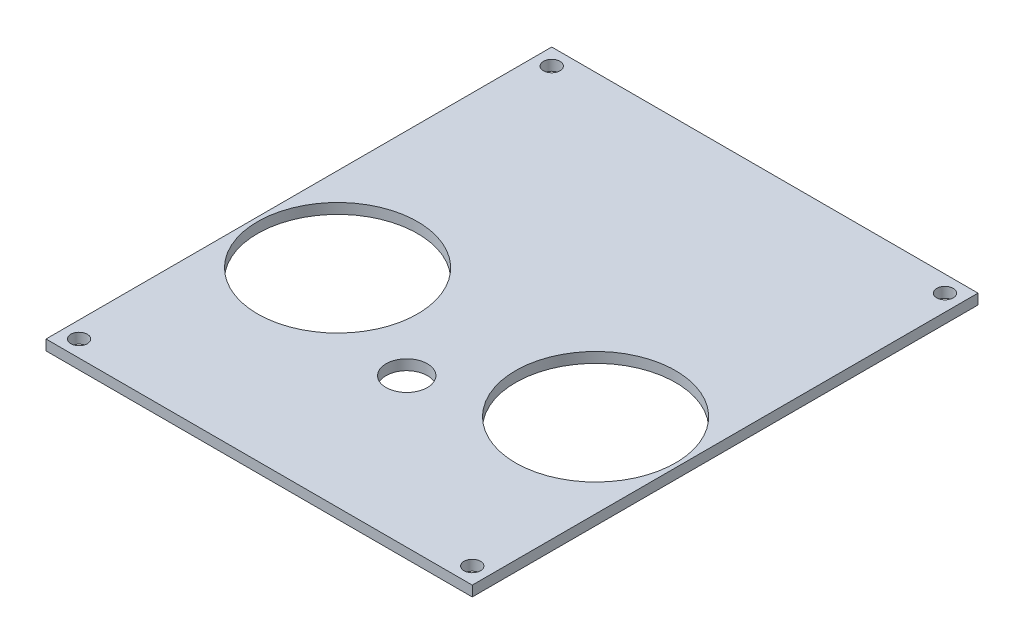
ISO-10303-21;
HEADER;
FILE_DESCRIPTION(('STEP AP214'),'2;1');
FILE_NAME('part.step','',(''),(''),'','','');
FILE_SCHEMA(('AUTOMOTIVE_DESIGN { 1 0 10303 214 1 1 1 1 }'));
ENDSEC;
DATA;
#1=APPLICATION_CONTEXT('core data for automotive mechanical design processes');
#2=APPLICATION_PROTOCOL_DEFINITION('international standard','automotive_design',2000,#1);
#3=PRODUCT_CONTEXT('',#1,'mechanical');
#4=PRODUCT('Part','Part','',(#3));
#5=PRODUCT_RELATED_PRODUCT_CATEGORY('part','',(#4));
#6=PRODUCT_DEFINITION_FORMATION('','',#4);
#7=PRODUCT_DEFINITION_CONTEXT('part definition',#1,'design');
#8=PRODUCT_DEFINITION('design','',#6,#7);
#9=PRODUCT_DEFINITION_SHAPE('','',#8);
#10=(LENGTH_UNIT() NAMED_UNIT(*) SI_UNIT(.MILLI.,.METRE.));
#11=(NAMED_UNIT(*) PLANE_ANGLE_UNIT() SI_UNIT($,.RADIAN.));
#12=(NAMED_UNIT(*) SI_UNIT($,.STERADIAN.) SOLID_ANGLE_UNIT());
#13=UNCERTAINTY_MEASURE_WITH_UNIT(LENGTH_MEASURE(1.E-05),#10,'distance_accuracy_value','');
#14=(GEOMETRIC_REPRESENTATION_CONTEXT(3) GLOBAL_UNCERTAINTY_ASSIGNED_CONTEXT((#13)) GLOBAL_UNIT_ASSIGNED_CONTEXT((#10,
#11,#12)) REPRESENTATION_CONTEXT('',''));
#15=CARTESIAN_POINT('',(0.,0.,0.));
#16=DIRECTION('',(0.,0.,1.));
#17=DIRECTION('',(1.,0.,0.));
#18=AXIS2_PLACEMENT_3D('',#15,#16,#17);
#19=CARTESIAN_POINT('',(-41.3,2.,-49.));
#20=DIRECTION('',(1.,0.,0.));
#21=DIRECTION('',(0.,0.,-1.));
#22=AXIS2_PLACEMENT_3D('',#19,#20,#21);
#23=PLANE('',#22);
#24=DIRECTION('',(0.,0.,1.));
#25=VECTOR('',#24,1.);
#26=CARTESIAN_POINT('',(-41.3,0.,-49.));
#27=LINE('',#26,#25);
#28=CARTESIAN_POINT('',(-41.3,0.,-49.));
#29=VERTEX_POINT('',#28);
#30=CARTESIAN_POINT('',(-41.3,0.,49.));
#31=VERTEX_POINT('',#30);
#32=EDGE_CURVE('E95',#29,#31,#27,.T.);
#33=ORIENTED_EDGE('',*,*,#32,.T.);
#34=DIRECTION('',(0.,-1.,0.));
#35=VECTOR('',#34,1.);
#36=CARTESIAN_POINT('',(-41.3,2.,49.));
#37=LINE('',#36,#35);
#38=CARTESIAN_POINT('',(-41.3,2.,49.));
#39=VERTEX_POINT('',#38);
#40=EDGE_CURVE('E11',#39,#31,#37,.T.);
#41=ORIENTED_EDGE('',*,*,#40,.F.);
#42=DIRECTION('',(0.,0.,1.));
#43=VECTOR('',#42,1.);
#44=CARTESIAN_POINT('',(-41.3,2.,-49.));
#45=LINE('',#44,#43);
#46=CARTESIAN_POINT('',(-41.3,2.,-49.));
#47=VERTEX_POINT('',#46);
#48=EDGE_CURVE('E83',#47,#39,#45,.T.);
#49=ORIENTED_EDGE('',*,*,#48,.F.);
#50=DIRECTION('',(0.,-1.,0.));
#51=VECTOR('',#50,1.);
#52=CARTESIAN_POINT('',(-41.3,2.,-49.));
#53=LINE('',#52,#51);
#54=EDGE_CURVE('E91',#47,#29,#53,.T.);
#55=ORIENTED_EDGE('',*,*,#54,.T.);
#56=EDGE_LOOP('',(#33,#41,#49,#55));
#57=FACE_BOUND('',#56,.T.);
#58=ADVANCED_FACE('F32',(#57),#23,.F.);
#59=CARTESIAN_POINT('',(41.3,2.,49.));
#60=DIRECTION('',(0.,0.,-1.));
#61=DIRECTION('',(-1.,0.,0.));
#62=AXIS2_PLACEMENT_3D('',#59,#60,#61);
#63=PLANE('',#62);
#64=DIRECTION('',(1.,0.,0.));
#65=VECTOR('',#64,1.);
#66=CARTESIAN_POINT('',(41.3,0.,49.));
#67=LINE('',#66,#65);
#68=CARTESIAN_POINT('',(41.3,0.,49.));
#69=VERTEX_POINT('',#68);
#70=EDGE_CURVE('E87',#31,#69,#67,.T.);
#71=ORIENTED_EDGE('',*,*,#70,.T.);
#72=DIRECTION('',(0.,-1.,0.));
#73=VECTOR('',#72,1.);
#74=CARTESIAN_POINT('',(41.3,2.,49.));
#75=LINE('',#74,#73);
#76=CARTESIAN_POINT('',(41.3,2.,49.));
#77=VERTEX_POINT('',#76);
#78=EDGE_CURVE('E40',#77,#69,#75,.T.);
#79=ORIENTED_EDGE('',*,*,#78,.F.);
#80=DIRECTION('',(1.,0.,0.));
#81=VECTOR('',#80,1.);
#82=CARTESIAN_POINT('',(41.3,2.,49.));
#83=LINE('',#82,#81);
#84=EDGE_CURVE('E78',#39,#77,#83,.T.);
#85=ORIENTED_EDGE('',*,*,#84,.F.);
#86=ORIENTED_EDGE('',*,*,#40,.T.);
#87=EDGE_LOOP('',(#71,#79,#85,#86));
#88=FACE_BOUND('',#87,.T.);
#89=ADVANCED_FACE('F86',(#88),#63,.F.);
#90=CARTESIAN_POINT('',(41.3,2.,-49.));
#91=DIRECTION('',(-1.,0.,0.));
#92=DIRECTION('',(0.,0.,1.));
#93=AXIS2_PLACEMENT_3D('',#90,#91,#92);
#94=PLANE('',#93);
#95=DIRECTION('',(0.,0.,-1.));
#96=VECTOR('',#95,1.);
#97=CARTESIAN_POINT('',(41.3,0.,-49.));
#98=LINE('',#97,#96);
#99=CARTESIAN_POINT('',(41.3,0.,-49.));
#100=VERTEX_POINT('',#99);
#101=EDGE_CURVE('E65',#69,#100,#98,.T.);
#102=ORIENTED_EDGE('',*,*,#101,.T.);
#103=DIRECTION('',(0.,-1.,0.));
#104=VECTOR('',#103,1.);
#105=CARTESIAN_POINT('',(41.3,2.,-49.));
#106=LINE('',#105,#104);
#107=CARTESIAN_POINT('',(41.3,2.,-49.));
#108=VERTEX_POINT('',#107);
#109=EDGE_CURVE('E88',#108,#100,#106,.T.);
#110=ORIENTED_EDGE('',*,*,#109,.F.);
#111=DIRECTION('',(0.,0.,-1.));
#112=VECTOR('',#111,1.);
#113=CARTESIAN_POINT('',(41.3,2.,-49.));
#114=LINE('',#113,#112);
#115=EDGE_CURVE('E81',#77,#108,#114,.T.);
#116=ORIENTED_EDGE('',*,*,#115,.F.);
#117=ORIENTED_EDGE('',*,*,#78,.T.);
#118=EDGE_LOOP('',(#102,#110,#116,#117));
#119=FACE_BOUND('',#118,.T.);
#120=ADVANCED_FACE('F89',(#119),#94,.F.);
#121=CARTESIAN_POINT('',(41.3,2.,-49.));
#122=DIRECTION('',(0.,0.,1.));
#123=DIRECTION('',(1.,0.,0.));
#124=AXIS2_PLACEMENT_3D('',#121,#122,#123);
#125=PLANE('',#124);
#126=DIRECTION('',(-1.,0.,0.));
#127=VECTOR('',#126,1.);
#128=CARTESIAN_POINT('',(41.3,0.,-49.));
#129=LINE('',#128,#127);
#130=EDGE_CURVE('E71',#100,#29,#129,.T.);
#131=ORIENTED_EDGE('',*,*,#130,.T.);
#132=ORIENTED_EDGE('',*,*,#54,.F.);
#133=DIRECTION('',(-1.,0.,0.));
#134=VECTOR('',#133,1.);
#135=CARTESIAN_POINT('',(41.3,2.,-49.));
#136=LINE('',#135,#134);
#137=EDGE_CURVE('E48',#108,#47,#136,.T.);
#138=ORIENTED_EDGE('',*,*,#137,.F.);
#139=ORIENTED_EDGE('',*,*,#109,.T.);
#140=EDGE_LOOP('',(#131,#132,#138,#139));
#141=FACE_BOUND('',#140,.T.);
#142=ADVANCED_FACE('F103',(#141),#125,.F.);
#143=CARTESIAN_POINT('',(0.,2.,0.));
#144=DIRECTION('',(0.,-1.,0.));
#145=DIRECTION('',(0.,0.,-1.));
#146=AXIS2_PLACEMENT_3D('',#143,#144,#145);
#147=PLANE('',#146);
#148=CARTESIAN_POINT('',(-0.199999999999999,2.,20.2));
#149=DIRECTION('',(0.,-1.,0.));
#150=DIRECTION('',(0.,0.,-1.));
#151=AXIS2_PLACEMENT_3D('',#148,#149,#150);
#152=CIRCLE('',#151,4.);
#153=CARTESIAN_POINT('',(-0.199999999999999,2.,16.2));
#154=VERTEX_POINT('',#153);
#155=EDGE_CURVE('E142',#154,#154,#152,.T.);
#156=ORIENTED_EDGE('',*,*,#155,.T.);
#157=EDGE_LOOP('',(#156));
#158=FACE_BOUND('',#157,.T.);
#159=CARTESIAN_POINT('',(25.,2.,8.8));
#160=DIRECTION('',(0.,1.,0.));
#161=DIRECTION('',(0.,0.,1.));
#162=AXIS2_PLACEMENT_3D('',#159,#160,#161);
#163=CIRCLE('',#162,15.5);
#164=CARTESIAN_POINT('',(25.,2.,24.3));
#165=VERTEX_POINT('',#164);
#166=EDGE_CURVE('E139',#165,#165,#163,.T.);
#167=ORIENTED_EDGE('',*,*,#166,.F.);
#168=EDGE_LOOP('',(#167));
#169=FACE_BOUND('',#168,.T.);
#170=CARTESIAN_POINT('',(-25.,2.,8.8));
#171=DIRECTION('',(0.,1.,0.));
#172=DIRECTION('',(0.,0.,1.));
#173=AXIS2_PLACEMENT_3D('',#170,#171,#172);
#174=CIRCLE('',#173,15.5);
#175=CARTESIAN_POINT('',(-25.,2.,24.3));
#176=VERTEX_POINT('',#175);
#177=EDGE_CURVE('E133',#176,#176,#174,.T.);
#178=ORIENTED_EDGE('',*,*,#177,.F.);
#179=EDGE_LOOP('',(#178));
#180=FACE_BOUND('',#179,.T.);
#181=CARTESIAN_POINT('',(-38.1,2.,-45.8));
#182=DIRECTION('',(0.,1.,0.));
#183=DIRECTION('',(0.,0.,1.));
#184=AXIS2_PLACEMENT_3D('',#181,#182,#183);
#185=CIRCLE('',#184,1.59999999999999);
#186=CARTESIAN_POINT('',(-38.1,2.,-44.2));
#187=VERTEX_POINT('',#186);
#188=EDGE_CURVE('E129',#187,#187,#185,.T.);
#189=ORIENTED_EDGE('',*,*,#188,.F.);
#190=EDGE_LOOP('',(#189));
#191=FACE_BOUND('',#190,.T.);
#192=CARTESIAN_POINT('',(38.1,2.,-45.8));
#193=DIRECTION('',(0.,1.,0.));
#194=DIRECTION('',(0.,0.,1.));
#195=AXIS2_PLACEMENT_3D('',#192,#193,#194);
#196=CIRCLE('',#195,1.59999999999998);
#197=CARTESIAN_POINT('',(38.1,2.,-44.2));
#198=VERTEX_POINT('',#197);
#199=EDGE_CURVE('E123',#198,#198,#196,.T.);
#200=ORIENTED_EDGE('',*,*,#199,.F.);
#201=EDGE_LOOP('',(#200));
#202=FACE_BOUND('',#201,.T.);
#203=CARTESIAN_POINT('',(38.1,2.,45.8));
#204=DIRECTION('',(0.,1.,0.));
#205=DIRECTION('',(0.,0.,1.));
#206=AXIS2_PLACEMENT_3D('',#203,#204,#205);
#207=CIRCLE('',#206,1.59999999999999);
#208=CARTESIAN_POINT('',(38.1,2.,47.4));
#209=VERTEX_POINT('',#208);
#210=EDGE_CURVE('E117',#209,#209,#207,.T.);
#211=ORIENTED_EDGE('',*,*,#210,.F.);
#212=EDGE_LOOP('',(#211));
#213=FACE_BOUND('',#212,.T.);
#214=CARTESIAN_POINT('',(-38.1,2.,45.8));
#215=DIRECTION('',(0.,1.,0.));
#216=DIRECTION('',(0.,0.,1.));
#217=AXIS2_PLACEMENT_3D('',#214,#215,#216);
#218=CIRCLE('',#217,1.59999999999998);
#219=CARTESIAN_POINT('',(-38.1,2.,47.4));
#220=VERTEX_POINT('',#219);
#221=EDGE_CURVE('E111',#220,#220,#218,.T.);
#222=ORIENTED_EDGE('',*,*,#221,.F.);
#223=EDGE_LOOP('',(#222));
#224=FACE_BOUND('',#223,.T.);
#225=ORIENTED_EDGE('',*,*,#48,.T.);
#226=ORIENTED_EDGE('',*,*,#84,.T.);
#227=ORIENTED_EDGE('',*,*,#115,.T.);
#228=ORIENTED_EDGE('',*,*,#137,.T.);
#229=EDGE_LOOP('',(#225,#226,#227,#228));
#230=FACE_BOUND('',#229,.T.);
#231=ADVANCED_FACE('F79',(#158,#169,#180,#191,#202,#213,#224,#230),#147,.F.);
#232=CARTESIAN_POINT('',(0.,0.,0.));
#233=DIRECTION('',(0.,-1.,0.));
#234=DIRECTION('',(0.,0.,-1.));
#235=AXIS2_PLACEMENT_3D('',#232,#233,#234);
#236=PLANE('',#235);
#237=CARTESIAN_POINT('',(-0.199999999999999,0.,20.2));
#238=DIRECTION('',(0.,-1.,0.));
#239=DIRECTION('',(0.,0.,-1.));
#240=AXIS2_PLACEMENT_3D('',#237,#238,#239);
#241=CIRCLE('',#240,4.);
#242=CARTESIAN_POINT('',(-0.199999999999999,0.,16.2));
#243=VERTEX_POINT('',#242);
#244=EDGE_CURVE('E147',#243,#243,#241,.T.);
#245=ORIENTED_EDGE('',*,*,#244,.F.);
#246=EDGE_LOOP('',(#245));
#247=FACE_BOUND('',#246,.T.);
#248=CARTESIAN_POINT('',(25.,0.,8.8));
#249=DIRECTION('',(0.,1.,0.));
#250=DIRECTION('',(0.,0.,1.));
#251=AXIS2_PLACEMENT_3D('',#248,#249,#250);
#252=CIRCLE('',#251,15.5);
#253=CARTESIAN_POINT('',(25.,0.,24.3));
#254=VERTEX_POINT('',#253);
#255=EDGE_CURVE('E136',#254,#254,#252,.T.);
#256=ORIENTED_EDGE('',*,*,#255,.T.);
#257=EDGE_LOOP('',(#256));
#258=FACE_BOUND('',#257,.T.);
#259=CARTESIAN_POINT('',(-25.,0.,8.8));
#260=DIRECTION('',(0.,1.,0.));
#261=DIRECTION('',(0.,0.,1.));
#262=AXIS2_PLACEMENT_3D('',#259,#260,#261);
#263=CIRCLE('',#262,15.5);
#264=CARTESIAN_POINT('',(-25.,0.,24.3));
#265=VERTEX_POINT('',#264);
#266=EDGE_CURVE('E132',#265,#265,#263,.T.);
#267=ORIENTED_EDGE('',*,*,#266,.T.);
#268=EDGE_LOOP('',(#267));
#269=FACE_BOUND('',#268,.T.);
#270=CARTESIAN_POINT('',(-38.1,0.,-45.8));
#271=DIRECTION('',(0.,1.,0.));
#272=DIRECTION('',(0.,0.,1.));
#273=AXIS2_PLACEMENT_3D('',#270,#271,#272);
#274=CIRCLE('',#273,1.59999999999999);
#275=CARTESIAN_POINT('',(-38.1,0.,-44.2));
#276=VERTEX_POINT('',#275);
#277=EDGE_CURVE('E126',#276,#276,#274,.T.);
#278=ORIENTED_EDGE('',*,*,#277,.T.);
#279=EDGE_LOOP('',(#278));
#280=FACE_BOUND('',#279,.T.);
#281=CARTESIAN_POINT('',(38.1,0.,-45.8));
#282=DIRECTION('',(0.,1.,0.));
#283=DIRECTION('',(0.,0.,1.));
#284=AXIS2_PLACEMENT_3D('',#281,#282,#283);
#285=CIRCLE('',#284,1.59999999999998);
#286=CARTESIAN_POINT('',(38.1,0.,-44.2));
#287=VERTEX_POINT('',#286);
#288=EDGE_CURVE('E120',#287,#287,#285,.T.);
#289=ORIENTED_EDGE('',*,*,#288,.T.);
#290=EDGE_LOOP('',(#289));
#291=FACE_BOUND('',#290,.T.);
#292=CARTESIAN_POINT('',(38.1,0.,45.8));
#293=DIRECTION('',(0.,1.,0.));
#294=DIRECTION('',(0.,0.,1.));
#295=AXIS2_PLACEMENT_3D('',#292,#293,#294);
#296=CIRCLE('',#295,1.59999999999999);
#297=CARTESIAN_POINT('',(38.1,0.,47.4));
#298=VERTEX_POINT('',#297);
#299=EDGE_CURVE('E114',#298,#298,#296,.T.);
#300=ORIENTED_EDGE('',*,*,#299,.T.);
#301=EDGE_LOOP('',(#300));
#302=FACE_BOUND('',#301,.T.);
#303=CARTESIAN_POINT('',(-38.1,0.,45.8));
#304=DIRECTION('',(0.,1.,0.));
#305=DIRECTION('',(0.,0.,1.));
#306=AXIS2_PLACEMENT_3D('',#303,#304,#305);
#307=CIRCLE('',#306,1.59999999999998);
#308=CARTESIAN_POINT('',(-38.1,0.,47.4));
#309=VERTEX_POINT('',#308);
#310=EDGE_CURVE('E98',#309,#309,#307,.T.);
#311=ORIENTED_EDGE('',*,*,#310,.T.);
#312=EDGE_LOOP('',(#311));
#313=FACE_BOUND('',#312,.T.);
#314=ORIENTED_EDGE('',*,*,#32,.F.);
#315=ORIENTED_EDGE('',*,*,#130,.F.);
#316=ORIENTED_EDGE('',*,*,#101,.F.);
#317=ORIENTED_EDGE('',*,*,#70,.F.);
#318=EDGE_LOOP('',(#314,#315,#316,#317));
#319=FACE_BOUND('',#318,.T.);
#320=ADVANCED_FACE('F106',(#247,#258,#269,#280,#291,#302,#313,#319),#236,.T.);
#321=CARTESIAN_POINT('',(-38.1,2.,45.8));
#322=DIRECTION('',(0.,1.,0.));
#323=DIRECTION('',(0.,0.,1.));
#324=AXIS2_PLACEMENT_3D('',#321,#322,#323);
#325=CYLINDRICAL_SURFACE('',#324,1.59999999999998);
#326=ORIENTED_EDGE('',*,*,#310,.F.);
#327=EDGE_LOOP('',(#326));
#328=FACE_BOUND('',#327,.T.);
#329=ORIENTED_EDGE('',*,*,#221,.T.);
#330=EDGE_LOOP('',(#329));
#331=FACE_BOUND('',#330,.T.);
#332=ADVANCED_FACE('F156',(#328,#331),#325,.F.);
#333=CARTESIAN_POINT('',(38.1,2.,45.8));
#334=DIRECTION('',(0.,1.,0.));
#335=DIRECTION('',(0.,0.,1.));
#336=AXIS2_PLACEMENT_3D('',#333,#334,#335);
#337=CYLINDRICAL_SURFACE('',#336,1.59999999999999);
#338=ORIENTED_EDGE('',*,*,#299,.F.);
#339=EDGE_LOOP('',(#338));
#340=FACE_BOUND('',#339,.T.);
#341=ORIENTED_EDGE('',*,*,#210,.T.);
#342=EDGE_LOOP('',(#341));
#343=FACE_BOUND('',#342,.T.);
#344=ADVANCED_FACE('F172',(#340,#343),#337,.F.);
#345=CARTESIAN_POINT('',(38.1,2.,-45.8));
#346=DIRECTION('',(0.,1.,0.));
#347=DIRECTION('',(0.,0.,1.));
#348=AXIS2_PLACEMENT_3D('',#345,#346,#347);
#349=CYLINDRICAL_SURFACE('',#348,1.59999999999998);
#350=ORIENTED_EDGE('',*,*,#288,.F.);
#351=EDGE_LOOP('',(#350));
#352=FACE_BOUND('',#351,.T.);
#353=ORIENTED_EDGE('',*,*,#199,.T.);
#354=EDGE_LOOP('',(#353));
#355=FACE_BOUND('',#354,.T.);
#356=ADVANCED_FACE('F220',(#352,#355),#349,.F.);
#357=CARTESIAN_POINT('',(-38.1,2.,-45.8));
#358=DIRECTION('',(0.,1.,0.));
#359=DIRECTION('',(0.,0.,1.));
#360=AXIS2_PLACEMENT_3D('',#357,#358,#359);
#361=CYLINDRICAL_SURFACE('',#360,1.59999999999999);
#362=ORIENTED_EDGE('',*,*,#277,.F.);
#363=EDGE_LOOP('',(#362));
#364=FACE_BOUND('',#363,.T.);
#365=ORIENTED_EDGE('',*,*,#188,.T.);
#366=EDGE_LOOP('',(#365));
#367=FACE_BOUND('',#366,.T.);
#368=ADVANCED_FACE('F228',(#364,#367),#361,.F.);
#369=CARTESIAN_POINT('',(-25.,0.,8.8));
#370=DIRECTION('',(0.,1.,0.));
#371=DIRECTION('',(0.,0.,1.));
#372=AXIS2_PLACEMENT_3D('',#369,#370,#371);
#373=CYLINDRICAL_SURFACE('',#372,15.5);
#374=ORIENTED_EDGE('',*,*,#266,.F.);
#375=EDGE_LOOP('',(#374));
#376=FACE_BOUND('',#375,.T.);
#377=ORIENTED_EDGE('',*,*,#177,.T.);
#378=EDGE_LOOP('',(#377));
#379=FACE_BOUND('',#378,.T.);
#380=ADVANCED_FACE('F236',(#376,#379),#373,.F.);
#381=CARTESIAN_POINT('',(25.,0.,8.8));
#382=DIRECTION('',(0.,1.,0.));
#383=DIRECTION('',(0.,0.,1.));
#384=AXIS2_PLACEMENT_3D('',#381,#382,#383);
#385=CYLINDRICAL_SURFACE('',#384,15.5);
#386=ORIENTED_EDGE('',*,*,#255,.F.);
#387=EDGE_LOOP('',(#386));
#388=FACE_BOUND('',#387,.T.);
#389=ORIENTED_EDGE('',*,*,#166,.T.);
#390=EDGE_LOOP('',(#389));
#391=FACE_BOUND('',#390,.T.);
#392=ADVANCED_FACE('F244',(#388,#391),#385,.F.);
#393=CARTESIAN_POINT('',(-0.199999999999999,10.,20.2));
#394=DIRECTION('',(0.,-1.,0.));
#395=DIRECTION('',(0.,0.,-1.));
#396=AXIS2_PLACEMENT_3D('',#393,#394,#395);
#397=CYLINDRICAL_SURFACE('',#396,4.);
#398=ORIENTED_EDGE('',*,*,#244,.T.);
#399=EDGE_LOOP('',(#398));
#400=FACE_BOUND('',#399,.T.);
#401=ORIENTED_EDGE('',*,*,#155,.F.);
#402=EDGE_LOOP('',(#401));
#403=FACE_BOUND('',#402,.T.);
#404=ADVANCED_FACE('F151',(#400,#403),#397,.F.);
#405=CLOSED_SHELL('',(#58,#89,#120,#142,#231,#320,#332,#344,#356,#368,#380,#392,#404));
#406=MANIFOLD_SOLID_BREP('B2',#405);
#407=ADVANCED_BREP_SHAPE_REPRESENTATION('',(#18,#406),#14);
#408=SHAPE_DEFINITION_REPRESENTATION(#9,#407);
ENDSEC;
END-ISO-10303-21;
